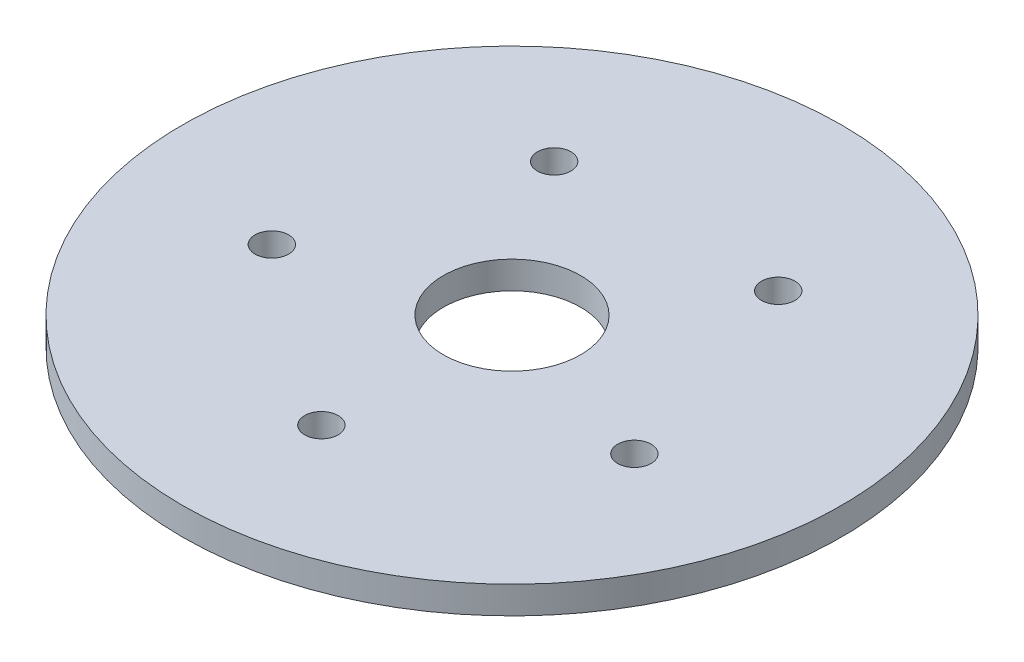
ISO-10303-21;
HEADER;
FILE_DESCRIPTION(('STEP AP214'),'2;1');
FILE_NAME('part.step','',(''),(''),'','','');
FILE_SCHEMA(('AUTOMOTIVE_DESIGN { 1 0 10303 214 1 1 1 1 }'));
ENDSEC;
DATA;
#1=APPLICATION_CONTEXT('core data for automotive mechanical design processes');
#2=APPLICATION_PROTOCOL_DEFINITION('international standard','automotive_design',2000,#1);
#3=PRODUCT_CONTEXT('',#1,'mechanical');
#4=PRODUCT('Part','Part','',(#3));
#5=PRODUCT_RELATED_PRODUCT_CATEGORY('part','',(#4));
#6=PRODUCT_DEFINITION_FORMATION('','',#4);
#7=PRODUCT_DEFINITION_CONTEXT('part definition',#1,'design');
#8=PRODUCT_DEFINITION('design','',#6,#7);
#9=PRODUCT_DEFINITION_SHAPE('','',#8);
#10=(LENGTH_UNIT() NAMED_UNIT(*) SI_UNIT(.MILLI.,.METRE.));
#11=(NAMED_UNIT(*) PLANE_ANGLE_UNIT() SI_UNIT($,.RADIAN.));
#12=(NAMED_UNIT(*) SI_UNIT($,.STERADIAN.) SOLID_ANGLE_UNIT());
#13=UNCERTAINTY_MEASURE_WITH_UNIT(LENGTH_MEASURE(1.E-05),#10,'distance_accuracy_value','');
#14=(GEOMETRIC_REPRESENTATION_CONTEXT(3) GLOBAL_UNCERTAINTY_ASSIGNED_CONTEXT((#13)) GLOBAL_UNIT_ASSIGNED_CONTEXT((#10,
#11,#12)) REPRESENTATION_CONTEXT('',''));
#15=CARTESIAN_POINT('',(0.,0.,0.));
#16=DIRECTION('',(0.,0.,1.));
#17=DIRECTION('',(1.,0.,0.));
#18=AXIS2_PLACEMENT_3D('',#15,#16,#17);
#19=CARTESIAN_POINT('',(0.,12.7,0.));
#20=DIRECTION('',(0.,-1.,0.));
#21=DIRECTION('',(0.,0.,-1.));
#22=AXIS2_PLACEMENT_3D('',#19,#20,#21);
#23=CYLINDRICAL_SURFACE('',#22,152.4);
#24=CARTESIAN_POINT('',(0.,12.7,0.));
#25=DIRECTION('',(0.,1.,0.));
#26=DIRECTION('',(0.,0.,1.));
#27=AXIS2_PLACEMENT_3D('',#24,#25,#26);
#28=CIRCLE('',#27,152.4);
#29=CARTESIAN_POINT('',(0.,12.7,152.4));
#30=VERTEX_POINT('',#29);
#31=EDGE_CURVE('E10',#30,#30,#28,.T.);
#32=ORIENTED_EDGE('',*,*,#31,.F.);
#33=EDGE_LOOP('',(#32));
#34=FACE_BOUND('',#33,.T.);
#35=CARTESIAN_POINT('',(0.,0.,0.));
#36=DIRECTION('',(0.,1.,0.));
#37=DIRECTION('',(0.,0.,1.));
#38=AXIS2_PLACEMENT_3D('',#35,#36,#37);
#39=CIRCLE('',#38,152.4);
#40=CARTESIAN_POINT('',(0.,0.,152.4));
#41=VERTEX_POINT('',#40);
#42=EDGE_CURVE('E34',#41,#41,#39,.T.);
#43=ORIENTED_EDGE('',*,*,#42,.T.);
#44=EDGE_LOOP('',(#43));
#45=FACE_BOUND('',#44,.T.);
#46=ADVANCED_FACE('F31',(#34,#45),#23,.T.);
#47=CARTESIAN_POINT('',(0.,12.7,0.));
#48=DIRECTION('',(0.,1.,0.));
#49=DIRECTION('',(0.,0.,1.));
#50=AXIS2_PLACEMENT_3D('',#47,#48,#49);
#51=PLANE('',#50);
#52=CARTESIAN_POINT('',(83.8357376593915,12.7,27.2398824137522));
#53=DIRECTION('',(0.,-1.,0.));
#54=DIRECTION('',(-0.95105651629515,0.,-0.309016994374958));
#55=AXIS2_PLACEMENT_3D('',#52,#53,#54);
#56=CIRCLE('',#55,7.75);
#57=CARTESIAN_POINT('',(76.4650496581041,12.7,24.8450007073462));
#58=VERTEX_POINT('',#57);
#59=EDGE_CURVE('E70',#58,#58,#56,.T.);
#60=ORIENTED_EDGE('',*,*,#59,.T.);
#61=EDGE_LOOP('',(#60));
#62=FACE_BOUND('',#61,.T.);
#63=CARTESIAN_POINT('',(51.8133353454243,12.7,-71.3149380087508));
#64=DIRECTION('',(0.,-1.,0.));
#65=DIRECTION('',(-0.58778525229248,0.,0.809016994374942));
#66=AXIS2_PLACEMENT_3D('',#63,#64,#65);
#67=CIRCLE('',#66,7.75);
#68=CARTESIAN_POINT('',(47.2579996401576,12.7,-65.045056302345));
#69=VERTEX_POINT('',#68);
#70=EDGE_CURVE('E64',#69,#69,#67,.T.);
#71=ORIENTED_EDGE('',*,*,#70,.T.);
#72=EDGE_LOOP('',(#71));
#73=FACE_BOUND('',#72,.T.);
#74=CARTESIAN_POINT('',(-51.8133353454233,12.7,-71.3149380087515));
#75=DIRECTION('',(0.,-1.,0.));
#76=DIRECTION('',(0.587785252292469,0.,0.809016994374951));
#77=AXIS2_PLACEMENT_3D('',#74,#75,#76);
#78=CIRCLE('',#77,7.75);
#79=CARTESIAN_POINT('',(-47.2579996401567,12.7,-65.0450563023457));
#80=VERTEX_POINT('',#79);
#81=EDGE_CURVE('E58',#80,#80,#78,.T.);
#82=ORIENTED_EDGE('',*,*,#81,.T.);
#83=EDGE_LOOP('',(#82));
#84=FACE_BOUND('',#83,.T.);
#85=CARTESIAN_POINT('',(-83.8357376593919,12.7,27.239882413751));
#86=DIRECTION('',(0.,-1.,0.));
#87=DIRECTION('',(0.951056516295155,0.,-0.309016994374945));
#88=AXIS2_PLACEMENT_3D('',#85,#86,#87);
#89=CIRCLE('',#88,7.75);
#90=CARTESIAN_POINT('',(-76.4650496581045,12.7,24.8450007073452));
#91=VERTEX_POINT('',#90);
#92=EDGE_CURVE('E52',#91,#91,#89,.T.);
#93=ORIENTED_EDGE('',*,*,#92,.T.);
#94=EDGE_LOOP('',(#93));
#95=FACE_BOUND('',#94,.T.);
#96=CARTESIAN_POINT('',(0.,12.7,88.15011119));
#97=DIRECTION('',(0.,-1.,0.));
#98=DIRECTION('',(0.,0.,-1.));
#99=AXIS2_PLACEMENT_3D('',#96,#97,#98);
#100=CIRCLE('',#99,7.75);
#101=CARTESIAN_POINT('',(0.,12.7,80.40011119));
#102=VERTEX_POINT('',#101);
#103=EDGE_CURVE('E46',#102,#102,#100,.T.);
#104=ORIENTED_EDGE('',*,*,#103,.T.);
#105=EDGE_LOOP('',(#104));
#106=FACE_BOUND('',#105,.T.);
#107=CARTESIAN_POINT('',(0.,12.7,0.));
#108=DIRECTION('',(0.,1.,0.));
#109=DIRECTION('',(0.,0.,1.));
#110=AXIS2_PLACEMENT_3D('',#107,#108,#109);
#111=CIRCLE('',#110,31.75);
#112=CARTESIAN_POINT('',(0.,12.7,31.75));
#113=VERTEX_POINT('',#112);
#114=EDGE_CURVE('E43',#113,#113,#111,.T.);
#115=ORIENTED_EDGE('',*,*,#114,.F.);
#116=EDGE_LOOP('',(#115));
#117=FACE_BOUND('',#116,.T.);
#118=ORIENTED_EDGE('',*,*,#31,.T.);
#119=EDGE_LOOP('',(#118));
#120=FACE_BOUND('',#119,.T.);
#121=ADVANCED_FACE('F79',(#62,#73,#84,#95,#106,#117,#120),#51,.T.);
#122=CARTESIAN_POINT('',(0.,0.,0.));
#123=DIRECTION('',(0.,1.,0.));
#124=DIRECTION('',(0.,0.,1.));
#125=AXIS2_PLACEMENT_3D('',#122,#123,#124);
#126=PLANE('',#125);
#127=CARTESIAN_POINT('',(83.8357376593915,0.,27.2398824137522));
#128=DIRECTION('',(0.,-1.,0.));
#129=DIRECTION('',(-0.95105651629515,0.,-0.309016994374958));
#130=AXIS2_PLACEMENT_3D('',#127,#128,#129);
#131=CIRCLE('',#130,7.75);
#132=CARTESIAN_POINT('',(76.4650496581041,0.,24.8450007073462));
#133=VERTEX_POINT('',#132);
#134=EDGE_CURVE('E73',#133,#133,#131,.T.);
#135=ORIENTED_EDGE('',*,*,#134,.F.);
#136=EDGE_LOOP('',(#135));
#137=FACE_BOUND('',#136,.T.);
#138=CARTESIAN_POINT('',(51.8133353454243,0.,-71.3149380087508));
#139=DIRECTION('',(0.,-1.,0.));
#140=DIRECTION('',(-0.58778525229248,0.,0.809016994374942));
#141=AXIS2_PLACEMENT_3D('',#138,#139,#140);
#142=CIRCLE('',#141,7.75);
#143=CARTESIAN_POINT('',(47.2579996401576,0.,-65.045056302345));
#144=VERTEX_POINT('',#143);
#145=EDGE_CURVE('E67',#144,#144,#142,.T.);
#146=ORIENTED_EDGE('',*,*,#145,.F.);
#147=EDGE_LOOP('',(#146));
#148=FACE_BOUND('',#147,.T.);
#149=CARTESIAN_POINT('',(-51.8133353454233,0.,-71.3149380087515));
#150=DIRECTION('',(0.,-1.,0.));
#151=DIRECTION('',(0.587785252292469,0.,0.809016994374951));
#152=AXIS2_PLACEMENT_3D('',#149,#150,#151);
#153=CIRCLE('',#152,7.75);
#154=CARTESIAN_POINT('',(-47.2579996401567,0.,-65.0450563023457));
#155=VERTEX_POINT('',#154);
#156=EDGE_CURVE('E61',#155,#155,#153,.T.);
#157=ORIENTED_EDGE('',*,*,#156,.F.);
#158=EDGE_LOOP('',(#157));
#159=FACE_BOUND('',#158,.T.);
#160=CARTESIAN_POINT('',(-83.8357376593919,0.,27.239882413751));
#161=DIRECTION('',(0.,-1.,0.));
#162=DIRECTION('',(0.951056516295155,0.,-0.309016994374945));
#163=AXIS2_PLACEMENT_3D('',#160,#161,#162);
#164=CIRCLE('',#163,7.75);
#165=CARTESIAN_POINT('',(-76.4650496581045,0.,24.8450007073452));
#166=VERTEX_POINT('',#165);
#167=EDGE_CURVE('E55',#166,#166,#164,.T.);
#168=ORIENTED_EDGE('',*,*,#167,.F.);
#169=EDGE_LOOP('',(#168));
#170=FACE_BOUND('',#169,.T.);
#171=CARTESIAN_POINT('',(0.,0.,88.15011119));
#172=DIRECTION('',(0.,-1.,0.));
#173=DIRECTION('',(0.,0.,-1.));
#174=AXIS2_PLACEMENT_3D('',#171,#172,#173);
#175=CIRCLE('',#174,7.75);
#176=CARTESIAN_POINT('',(0.,0.,80.40011119));
#177=VERTEX_POINT('',#176);
#178=EDGE_CURVE('E49',#177,#177,#175,.T.);
#179=ORIENTED_EDGE('',*,*,#178,.F.);
#180=EDGE_LOOP('',(#179));
#181=FACE_BOUND('',#180,.T.);
#182=CARTESIAN_POINT('',(0.,0.,0.));
#183=DIRECTION('',(0.,1.,0.));
#184=DIRECTION('',(0.,0.,1.));
#185=AXIS2_PLACEMENT_3D('',#182,#183,#184);
#186=CIRCLE('',#185,31.75);
#187=CARTESIAN_POINT('',(0.,0.,31.75));
#188=VERTEX_POINT('',#187);
#189=EDGE_CURVE('E41',#188,#188,#186,.T.);
#190=ORIENTED_EDGE('',*,*,#189,.T.);
#191=EDGE_LOOP('',(#190));
#192=FACE_BOUND('',#191,.T.);
#193=ORIENTED_EDGE('',*,*,#42,.F.);
#194=EDGE_LOOP('',(#193));
#195=FACE_BOUND('',#194,.T.);
#196=ADVANCED_FACE('F89',(#137,#148,#159,#170,#181,#192,#195),#126,.F.);
#197=CARTESIAN_POINT('',(0.,0.,0.));
#198=DIRECTION('',(0.,1.,0.));
#199=DIRECTION('',(0.,0.,1.));
#200=AXIS2_PLACEMENT_3D('',#197,#198,#199);
#201=CYLINDRICAL_SURFACE('',#200,31.75);
#202=ORIENTED_EDGE('',*,*,#189,.F.);
#203=EDGE_LOOP('',(#202));
#204=FACE_BOUND('',#203,.T.);
#205=ORIENTED_EDGE('',*,*,#114,.T.);
#206=EDGE_LOOP('',(#205));
#207=FACE_BOUND('',#206,.T.);
#208=ADVANCED_FACE('F92',(#204,#207),#201,.F.);
#209=CARTESIAN_POINT('',(0.,12.7,88.15011119));
#210=DIRECTION('',(0.,-1.,0.));
#211=DIRECTION('',(0.,0.,-1.));
#212=AXIS2_PLACEMENT_3D('',#209,#210,#211);
#213=CYLINDRICAL_SURFACE('',#212,7.75);
#214=ORIENTED_EDGE('',*,*,#103,.F.);
#215=EDGE_LOOP('',(#214));
#216=FACE_BOUND('',#215,.T.);
#217=ORIENTED_EDGE('',*,*,#178,.T.);
#218=EDGE_LOOP('',(#217));
#219=FACE_BOUND('',#218,.T.);
#220=ADVANCED_FACE('F116',(#216,#219),#213,.F.);
#221=CARTESIAN_POINT('',(-83.8357376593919,12.7,27.239882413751));
#222=DIRECTION('',(0.,-1.,0.));
#223=DIRECTION('',(0.,0.,-1.));
#224=AXIS2_PLACEMENT_3D('',#221,#222,#223);
#225=CYLINDRICAL_SURFACE('',#224,7.75);
#226=ORIENTED_EDGE('',*,*,#92,.F.);
#227=EDGE_LOOP('',(#226));
#228=FACE_BOUND('',#227,.T.);
#229=ORIENTED_EDGE('',*,*,#167,.T.);
#230=EDGE_LOOP('',(#229));
#231=FACE_BOUND('',#230,.T.);
#232=ADVANCED_FACE('F120',(#228,#231),#225,.F.);
#233=CARTESIAN_POINT('',(-51.8133353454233,12.7,-71.3149380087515));
#234=DIRECTION('',(0.,-1.,0.));
#235=DIRECTION('',(0.,0.,-1.));
#236=AXIS2_PLACEMENT_3D('',#233,#234,#235);
#237=CYLINDRICAL_SURFACE('',#236,7.75);
#238=ORIENTED_EDGE('',*,*,#81,.F.);
#239=EDGE_LOOP('',(#238));
#240=FACE_BOUND('',#239,.T.);
#241=ORIENTED_EDGE('',*,*,#156,.T.);
#242=EDGE_LOOP('',(#241));
#243=FACE_BOUND('',#242,.T.);
#244=ADVANCED_FACE('F124',(#240,#243),#237,.F.);
#245=CARTESIAN_POINT('',(51.8133353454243,12.7,-71.3149380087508));
#246=DIRECTION('',(0.,-1.,0.));
#247=DIRECTION('',(0.,0.,-1.));
#248=AXIS2_PLACEMENT_3D('',#245,#246,#247);
#249=CYLINDRICAL_SURFACE('',#248,7.75);
#250=ORIENTED_EDGE('',*,*,#70,.F.);
#251=EDGE_LOOP('',(#250));
#252=FACE_BOUND('',#251,.T.);
#253=ORIENTED_EDGE('',*,*,#145,.T.);
#254=EDGE_LOOP('',(#253));
#255=FACE_BOUND('',#254,.T.);
#256=ADVANCED_FACE('F85',(#252,#255),#249,.F.);
#257=CARTESIAN_POINT('',(83.8357376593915,12.7,27.2398824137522));
#258=DIRECTION('',(0.,-1.,0.));
#259=DIRECTION('',(0.,0.,-1.));
#260=AXIS2_PLACEMENT_3D('',#257,#258,#259);
#261=CYLINDRICAL_SURFACE('',#260,7.75);
#262=ORIENTED_EDGE('',*,*,#59,.F.);
#263=EDGE_LOOP('',(#262));
#264=FACE_BOUND('',#263,.T.);
#265=ORIENTED_EDGE('',*,*,#134,.T.);
#266=EDGE_LOOP('',(#265));
#267=FACE_BOUND('',#266,.T.);
#268=ADVANCED_FACE('F82',(#264,#267),#261,.F.);
#269=CLOSED_SHELL('',(#46,#121,#196,#208,#220,#232,#244,#256,#268));
#270=MANIFOLD_SOLID_BREP('B2',#269);
#271=ADVANCED_BREP_SHAPE_REPRESENTATION('',(#18,#270),#14);
#272=SHAPE_DEFINITION_REPRESENTATION(#9,#271);
ENDSEC;
END-ISO-10303-21;
